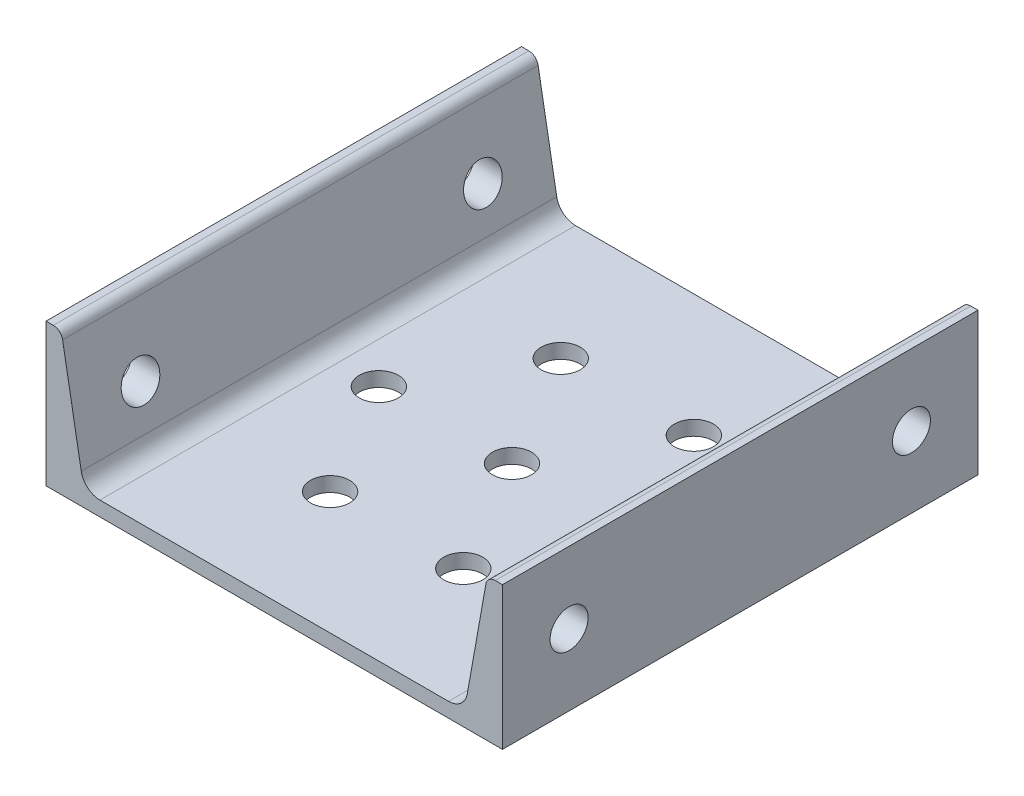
from build123d import *

# Parameters (mm, degrees)
BOSS_EXTRUDE1_DEPTH = 158.75
SKETCH2_R           = 6.5405
CUT_EXTRUDE1_DEPTH  = 225.173248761
SKETCH3_R           = 6.35
CUT_EXTRUDE2_DEPTH  = 226.156530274


with BuildPart() as part:
    # Sketch1 → Boss-Extrude1 (new body)
    with BuildSketch(Plane.XY):
        with BuildLine():
            Line((0, 0), (0, 47.625))
            Line((0, 47.625), (2.421045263, 47.625))
            ThreePointArc((2.421045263, 47.625), (4.459561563, 46.884147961), (5.546746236, 45.007331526))
            Line((5.546746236, 45.007331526), (11.766507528, 10.124836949))
            ThreePointArc((11.766507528, 10.124836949), (13.940876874, 6.371204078), (18.017909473, 4.8895))
            Line((18.017909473, 4.8895), (134.382090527, 4.8895))
            ThreePointArc((134.382090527, 4.8895), (138.459123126, 6.371204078), (140.633492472, 10.124836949))
            Line((140.633492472, 10.124836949), (146.853253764, 45.007331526))
            ThreePointArc((146.853253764, 45.007331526), (147.940438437, 46.884147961), (149.978954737, 47.625))
            Line((149.978954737, 47.625), (152.4, 47.625))
            Line((152.4, 47.625), (152.4, 0))
            Line((152.4, 0), (0, 0))
        make_face()
    extrude(amount=-BOSS_EXTRUDE1_DEPTH)

    # Sketch2 → Cut-Extrude1 (cut, through all)
    with BuildSketch(Plane(origin=(0, 4.8895, 0), x_dir=(1, 0, 0), z_dir=(0, 1, 0))):
        with Locations(Location((98.425, 117.869829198, 0), (0, 0, 270))):
            Circle(SKETCH2_R)
        with Locations(Location((120.65, 79.375, 0), (0, 0, 270))):
            Circle(SKETCH2_R)
        with Locations(Location((98.425, 40.880170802, 0), (0, 0, 270))):
            Circle(SKETCH2_R)
        with Locations(Location((53.975, 40.880170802, 0), (0, 0, 270))):
            Circle(SKETCH2_R)
        with Locations(Location((76.2, 79.375, 0), (0, 0, 270))):
            Circle(SKETCH2_R)
        with Locations(Location((53.975, 117.869829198, 0), (0, 0, 270))):
            Circle(SKETCH2_R)
        with Locations(Location((31.75, 79.375, 0), (0, 0, 270))):
            Circle(SKETCH2_R)
    extrude(amount=-CUT_EXTRUDE1_DEPTH, mode=Mode.SUBTRACT)

    # Sketch3 → Cut-Extrude2 (cut, through all)
    with BuildSketch(Plane.ZY):
        with Locations((-136.525, 23.8125)):
            Circle(SKETCH3_R)
        with Locations((-22.225, 23.8125)):
            Circle(SKETCH3_R)
    extrude(amount=-CUT_EXTRUDE2_DEPTH, mode=Mode.SUBTRACT)


solid = part.part
